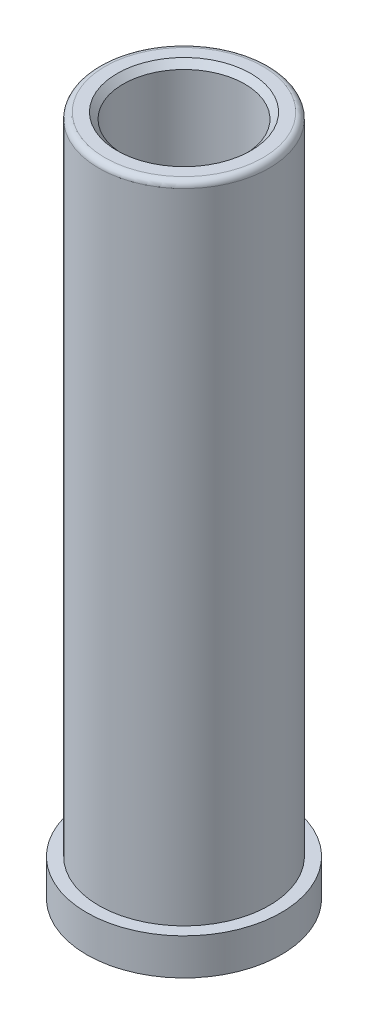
ISO-10303-21;
HEADER;
FILE_DESCRIPTION(('STEP AP214'),'2;1');
FILE_NAME('part.step','',(''),(''),'','','');
FILE_SCHEMA(('AUTOMOTIVE_DESIGN { 1 0 10303 214 1 1 1 1 }'));
ENDSEC;
DATA;
#1=APPLICATION_CONTEXT('core data for automotive mechanical design processes');
#2=APPLICATION_PROTOCOL_DEFINITION('international standard','automotive_design',2000,#1);
#3=PRODUCT_CONTEXT('',#1,'mechanical');
#4=PRODUCT('Part','Part','',(#3));
#5=PRODUCT_RELATED_PRODUCT_CATEGORY('part','',(#4));
#6=PRODUCT_DEFINITION_FORMATION('','',#4);
#7=PRODUCT_DEFINITION_CONTEXT('part definition',#1,'design');
#8=PRODUCT_DEFINITION('design','',#6,#7);
#9=PRODUCT_DEFINITION_SHAPE('','',#8);
#10=(LENGTH_UNIT() NAMED_UNIT(*) SI_UNIT(.MILLI.,.METRE.));
#11=(NAMED_UNIT(*) PLANE_ANGLE_UNIT() SI_UNIT($,.RADIAN.));
#12=(NAMED_UNIT(*) SI_UNIT($,.STERADIAN.) SOLID_ANGLE_UNIT());
#13=UNCERTAINTY_MEASURE_WITH_UNIT(LENGTH_MEASURE(1.E-05),#10,'distance_accuracy_value','');
#14=(GEOMETRIC_REPRESENTATION_CONTEXT(3) GLOBAL_UNCERTAINTY_ASSIGNED_CONTEXT((#13)) GLOBAL_UNIT_ASSIGNED_CONTEXT((#10,
#11,#12)) REPRESENTATION_CONTEXT('',''));
#15=CARTESIAN_POINT('',(0.,0.,0.));
#16=DIRECTION('',(0.,0.,1.));
#17=DIRECTION('',(1.,0.,0.));
#18=AXIS2_PLACEMENT_3D('',#15,#16,#17);
#19=CARTESIAN_POINT('',(0.,0.,0.));
#20=DIRECTION('',(0.,-1.,0.));
#21=DIRECTION('',(0.,0.,-1.));
#22=AXIS2_PLACEMENT_3D('',#19,#20,#21);
#23=CYLINDRICAL_SURFACE('',#22,7.);
#24=CARTESIAN_POINT('',(0.,52.5,0.));
#25=DIRECTION('',(0.,-1.,0.));
#26=DIRECTION('',(0.,0.,-1.));
#27=AXIS2_PLACEMENT_3D('',#24,#25,#26);
#28=CIRCLE('',#27,7.);
#29=CARTESIAN_POINT('',(0.,52.5,-7.));
#30=VERTEX_POINT('',#29);
#31=EDGE_CURVE('E20',#30,#30,#28,.T.);
#32=ORIENTED_EDGE('',*,*,#31,.T.);
#33=EDGE_LOOP('',(#32));
#34=FACE_BOUND('',#33,.T.);
#35=CARTESIAN_POINT('',(0.,0.,0.));
#36=DIRECTION('',(0.,-1.,0.));
#37=DIRECTION('',(0.,0.,-1.));
#38=AXIS2_PLACEMENT_3D('',#35,#36,#37);
#39=CIRCLE('',#38,7.);
#40=CARTESIAN_POINT('',(0.,0.,-7.));
#41=VERTEX_POINT('',#40);
#42=EDGE_CURVE('E48',#41,#41,#39,.T.);
#43=ORIENTED_EDGE('',*,*,#42,.F.);
#44=EDGE_LOOP('',(#43));
#45=FACE_BOUND('',#44,.T.);
#46=ADVANCED_FACE('F13',(#34,#45),#23,.T.);
#47=CARTESIAN_POINT('',(-7.,53.,0.));
#48=DIRECTION('',(0.,-1.,0.));
#49=DIRECTION('',(0.,0.,-1.));
#50=AXIS2_PLACEMENT_3D('',#47,#48,#49);
#51=PLANE('',#50);
#52=CARTESIAN_POINT('',(0.,53.,0.));
#53=DIRECTION('',(0.,-1.,0.));
#54=DIRECTION('',(0.,0.,-1.));
#55=AXIS2_PLACEMENT_3D('',#52,#53,#54);
#56=CIRCLE('',#55,6.5);
#57=CARTESIAN_POINT('',(0.,53.,-6.5));
#58=VERTEX_POINT('',#57);
#59=EDGE_CURVE('E8',#58,#58,#56,.F.);
#60=ORIENTED_EDGE('',*,*,#59,.T.);
#61=EDGE_LOOP('',(#60));
#62=FACE_BOUND('',#61,.T.);
#63=CARTESIAN_POINT('',(0.,53.,0.));
#64=DIRECTION('',(0.,-1.,0.));
#65=DIRECTION('',(0.,0.,-1.));
#66=AXIS2_PLACEMENT_3D('',#63,#64,#65);
#67=CIRCLE('',#66,5.5);
#68=CARTESIAN_POINT('',(0.,53.,-5.5));
#69=VERTEX_POINT('',#68);
#70=EDGE_CURVE('E36',#69,#69,#67,.T.);
#71=ORIENTED_EDGE('',*,*,#70,.T.);
#72=EDGE_LOOP('',(#71));
#73=FACE_BOUND('',#72,.T.);
#74=ADVANCED_FACE('F55',(#62,#73),#51,.F.);
#75=CARTESIAN_POINT('',(0.,0.,0.));
#76=DIRECTION('',(0.,-1.,0.));
#77=DIRECTION('',(0.,0.,-1.));
#78=AXIS2_PLACEMENT_3D('',#75,#76,#77);
#79=CYLINDRICAL_SURFACE('',#78,5.);
#80=CARTESIAN_POINT('',(0.,52.5,0.));
#81=DIRECTION('',(0.,-1.,0.));
#82=DIRECTION('',(0.,0.,-1.));
#83=AXIS2_PLACEMENT_3D('',#80,#81,#82);
#84=CIRCLE('',#83,5.);
#85=CARTESIAN_POINT('',(0.,52.5,-5.));
#86=VERTEX_POINT('',#85);
#87=EDGE_CURVE('E33',#86,#86,#84,.F.);
#88=ORIENTED_EDGE('',*,*,#87,.T.);
#89=EDGE_LOOP('',(#88));
#90=FACE_BOUND('',#89,.T.);
#91=CARTESIAN_POINT('',(0.,-3.,0.));
#92=DIRECTION('',(0.,-1.,0.));
#93=DIRECTION('',(0.,0.,-1.));
#94=AXIS2_PLACEMENT_3D('',#91,#92,#93);
#95=CIRCLE('',#94,5.);
#96=CARTESIAN_POINT('',(0.,-3.,-5.));
#97=VERTEX_POINT('',#96);
#98=EDGE_CURVE('E39',#97,#97,#95,.T.);
#99=ORIENTED_EDGE('',*,*,#98,.T.);
#100=EDGE_LOOP('',(#99));
#101=FACE_BOUND('',#100,.T.);
#102=ADVANCED_FACE('F62',(#90,#101),#79,.F.);
#103=CARTESIAN_POINT('',(0.,-3.15,0.));
#104=DIRECTION('',(0.,-1.,0.));
#105=DIRECTION('',(0.,0.,-1.));
#106=AXIS2_PLACEMENT_3D('',#103,#104,#105);
#107=CONICAL_SURFACE('',#106,5.1,0.588002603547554);
#108=CARTESIAN_POINT('',(0.,-3.36,0.));
#109=DIRECTION('',(0.,1.,0.));
#110=DIRECTION('',(0.,0.,1.));
#111=AXIS2_PLACEMENT_3D('',#108,#109,#110);
#112=CIRCLE('',#111,5.24);
#113=CARTESIAN_POINT('',(0.,-3.36,5.24));
#114=VERTEX_POINT('',#113);
#115=EDGE_CURVE('E24',#114,#114,#112,.F.);
#116=ORIENTED_EDGE('',*,*,#115,.T.);
#117=EDGE_LOOP('',(#116));
#118=FACE_BOUND('',#117,.T.);
#119=ORIENTED_EDGE('',*,*,#98,.F.);
#120=EDGE_LOOP('',(#119));
#121=FACE_BOUND('',#120,.T.);
#122=ADVANCED_FACE('F81',(#118,#121),#107,.F.);
#123=CARTESIAN_POINT('',(-5.1,-3.,0.));
#124=DIRECTION('',(0.,1.,0.));
#125=DIRECTION('',(0.,0.,1.));
#126=AXIS2_PLACEMENT_3D('',#123,#124,#125);
#127=PLANE('',#126);
#128=CARTESIAN_POINT('',(0.,-3.,0.));
#129=DIRECTION('',(0.,1.,0.));
#130=DIRECTION('',(0.,0.,1.));
#131=AXIS2_PLACEMENT_3D('',#128,#129,#130);
#132=CIRCLE('',#131,5.6);
#133=CARTESIAN_POINT('',(0.,-3.,5.6));
#134=VERTEX_POINT('',#133);
#135=EDGE_CURVE('E28',#134,#134,#132,.T.);
#136=ORIENTED_EDGE('',*,*,#135,.T.);
#137=EDGE_LOOP('',(#136));
#138=FACE_BOUND('',#137,.T.);
#139=CARTESIAN_POINT('',(0.,-3.,0.));
#140=DIRECTION('',(0.,-1.,0.));
#141=DIRECTION('',(0.,0.,-1.));
#142=AXIS2_PLACEMENT_3D('',#139,#140,#141);
#143=CIRCLE('',#142,8.);
#144=CARTESIAN_POINT('',(0.,-3.,-8.));
#145=VERTEX_POINT('',#144);
#146=EDGE_CURVE('E42',#145,#145,#143,.T.);
#147=ORIENTED_EDGE('',*,*,#146,.T.);
#148=EDGE_LOOP('',(#147));
#149=FACE_BOUND('',#148,.T.);
#150=ADVANCED_FACE('F84',(#138,#149),#127,.F.);
#151=CARTESIAN_POINT('',(0.,0.,0.));
#152=DIRECTION('',(0.,-1.,0.));
#153=DIRECTION('',(0.,0.,-1.));
#154=AXIS2_PLACEMENT_3D('',#151,#152,#153);
#155=CYLINDRICAL_SURFACE('',#154,8.);
#156=ORIENTED_EDGE('',*,*,#146,.F.);
#157=EDGE_LOOP('',(#156));
#158=FACE_BOUND('',#157,.T.);
#159=CARTESIAN_POINT('',(0.,0.,0.));
#160=DIRECTION('',(0.,-1.,0.));
#161=DIRECTION('',(0.,0.,-1.));
#162=AXIS2_PLACEMENT_3D('',#159,#160,#161);
#163=CIRCLE('',#162,8.);
#164=CARTESIAN_POINT('',(0.,0.,-8.));
#165=VERTEX_POINT('',#164);
#166=EDGE_CURVE('E45',#165,#165,#163,.T.);
#167=ORIENTED_EDGE('',*,*,#166,.T.);
#168=EDGE_LOOP('',(#167));
#169=FACE_BOUND('',#168,.T.);
#170=ADVANCED_FACE('F96',(#158,#169),#155,.T.);
#171=CARTESIAN_POINT('',(-8.,0.,0.));
#172=DIRECTION('',(0.,-1.,0.));
#173=DIRECTION('',(0.,0.,-1.));
#174=AXIS2_PLACEMENT_3D('',#171,#172,#173);
#175=PLANE('',#174);
#176=ORIENTED_EDGE('',*,*,#166,.F.);
#177=EDGE_LOOP('',(#176));
#178=FACE_BOUND('',#177,.T.);
#179=ORIENTED_EDGE('',*,*,#42,.T.);
#180=EDGE_LOOP('',(#179));
#181=FACE_BOUND('',#180,.T.);
#182=ADVANCED_FACE('F52',(#178,#181),#175,.F.);
#183=CARTESIAN_POINT('',(0.,53.,0.));
#184=DIRECTION('',(0.,1.,0.));
#185=DIRECTION('',(0.,0.,1.));
#186=AXIS2_PLACEMENT_3D('',#183,#184,#185);
#187=CONICAL_SURFACE('',#186,5.5,0.785398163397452);
#188=ORIENTED_EDGE('',*,*,#87,.F.);
#189=EDGE_LOOP('',(#188));
#190=FACE_BOUND('',#189,.T.);
#191=ORIENTED_EDGE('',*,*,#70,.F.);
#192=EDGE_LOOP('',(#191));
#193=FACE_BOUND('',#192,.T.);
#194=ADVANCED_FACE('F66',(#190,#193),#187,.F.);
#195=CARTESIAN_POINT('',(0.,-3.5,0.));
#196=DIRECTION('',(0.,1.,0.));
#197=DIRECTION('',(0.,0.,1.));
#198=AXIS2_PLACEMENT_3D('',#195,#196,#197);
#199=CONICAL_SURFACE('',#198,5.1,0.785398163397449);
#200=ORIENTED_EDGE('',*,*,#135,.F.);
#201=EDGE_LOOP('',(#200));
#202=FACE_BOUND('',#201,.T.);
#203=ORIENTED_EDGE('',*,*,#115,.F.);
#204=EDGE_LOOP('',(#203));
#205=FACE_BOUND('',#204,.T.);
#206=ADVANCED_FACE('F68',(#202,#205),#199,.T.);
#207=CARTESIAN_POINT('',(0.,52.5,0.));
#208=DIRECTION('',(0.,-1.,0.));
#209=DIRECTION('',(0.,0.,-1.));
#210=AXIS2_PLACEMENT_3D('',#207,#208,#209);
#211=TOROIDAL_SURFACE('',#210,6.5,0.5);
#212=ORIENTED_EDGE('',*,*,#59,.F.);
#213=EDGE_LOOP('',(#212));
#214=FACE_BOUND('',#213,.T.);
#215=ORIENTED_EDGE('',*,*,#31,.F.);
#216=EDGE_LOOP('',(#215));
#217=FACE_BOUND('',#216,.T.);
#218=ADVANCED_FACE('F15',(#214,#217),#211,.T.);
#219=CLOSED_SHELL('',(#46,#74,#102,#122,#150,#170,#182,#194,#206,#218));
#220=MANIFOLD_SOLID_BREP('B1',#219);
#221=ADVANCED_BREP_SHAPE_REPRESENTATION('',(#18,#220),#14);
#222=SHAPE_DEFINITION_REPRESENTATION(#9,#221);
ENDSEC;
END-ISO-10303-21;
